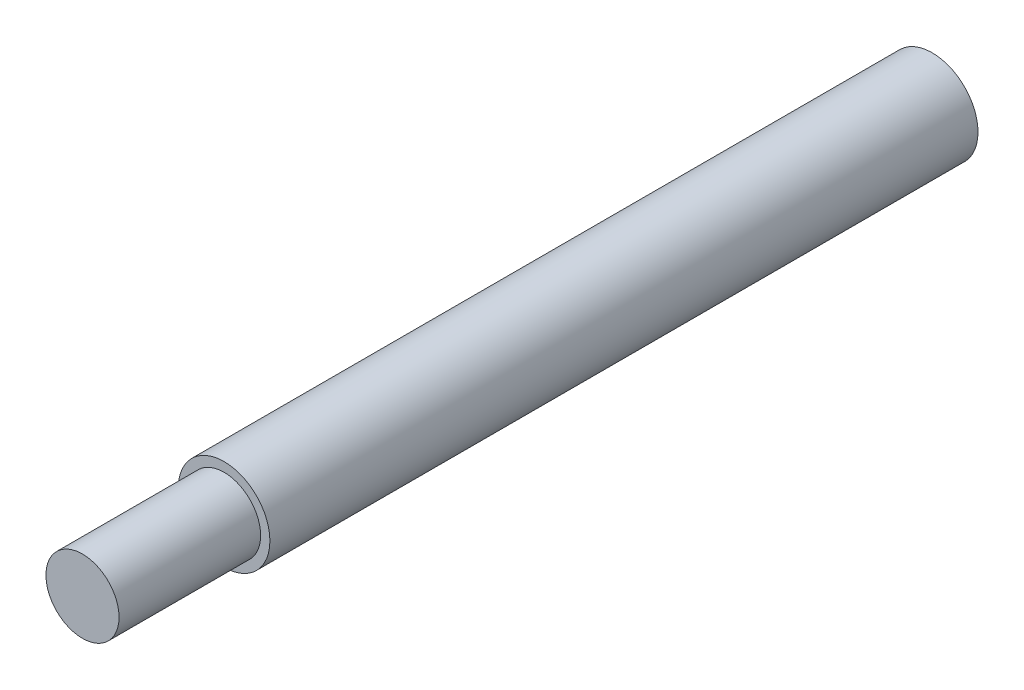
ISO-10303-21;
HEADER;
FILE_DESCRIPTION(('STEP AP214'),'2;1');
FILE_NAME('part.step','',(''),(''),'','','');
FILE_SCHEMA(('AUTOMOTIVE_DESIGN { 1 0 10303 214 1 1 1 1 }'));
ENDSEC;
DATA;
#1=APPLICATION_CONTEXT('core data for automotive mechanical design processes');
#2=APPLICATION_PROTOCOL_DEFINITION('international standard','automotive_design',2000,#1);
#3=PRODUCT_CONTEXT('',#1,'mechanical');
#4=PRODUCT('Part','Part','',(#3));
#5=PRODUCT_RELATED_PRODUCT_CATEGORY('part','',(#4));
#6=PRODUCT_DEFINITION_FORMATION('','',#4);
#7=PRODUCT_DEFINITION_CONTEXT('part definition',#1,'design');
#8=PRODUCT_DEFINITION('design','',#6,#7);
#9=PRODUCT_DEFINITION_SHAPE('','',#8);
#10=(LENGTH_UNIT() NAMED_UNIT(*) SI_UNIT(.MILLI.,.METRE.));
#11=(NAMED_UNIT(*) PLANE_ANGLE_UNIT() SI_UNIT($,.RADIAN.));
#12=(NAMED_UNIT(*) SI_UNIT($,.STERADIAN.) SOLID_ANGLE_UNIT());
#13=UNCERTAINTY_MEASURE_WITH_UNIT(LENGTH_MEASURE(1.E-05),#10,'distance_accuracy_value','');
#14=(GEOMETRIC_REPRESENTATION_CONTEXT(3) GLOBAL_UNCERTAINTY_ASSIGNED_CONTEXT((#13)) GLOBAL_UNIT_ASSIGNED_CONTEXT((#10,
#11,#12)) REPRESENTATION_CONTEXT('',''));
#15=CARTESIAN_POINT('',(0.,0.,0.));
#16=DIRECTION('',(0.,0.,1.));
#17=DIRECTION('',(1.,0.,0.));
#18=AXIS2_PLACEMENT_3D('',#15,#16,#17);
#19=CARTESIAN_POINT('',(0.,0.,155.));
#20=DIRECTION('',(0.,0.,1.));
#21=DIRECTION('',(1.,0.,0.));
#22=AXIS2_PLACEMENT_3D('',#19,#20,#21);
#23=PLANE('',#22);
#24=CARTESIAN_POINT('',(0.,0.,155.));
#25=DIRECTION('',(0.,0.,1.));
#26=DIRECTION('',(1.,0.,0.));
#27=AXIS2_PLACEMENT_3D('',#24,#25,#26);
#28=CIRCLE('',#27,10.025);
#29=CARTESIAN_POINT('',(10.025,0.,155.));
#30=VERTEX_POINT('',#29);
#31=EDGE_CURVE('E10',#30,#30,#28,.T.);
#32=ORIENTED_EDGE('',*,*,#31,.T.);
#33=EDGE_LOOP('',(#32));
#34=FACE_BOUND('',#33,.T.);
#35=CARTESIAN_POINT('',(0.,0.,155.));
#36=DIRECTION('',(0.,0.,1.));
#37=DIRECTION('',(1.,0.,0.));
#38=AXIS2_PLACEMENT_3D('',#35,#36,#37);
#39=CIRCLE('',#38,8.);
#40=CARTESIAN_POINT('',(8.,0.,155.));
#41=VERTEX_POINT('',#40);
#42=EDGE_CURVE('E46',#41,#41,#39,.T.);
#43=ORIENTED_EDGE('',*,*,#42,.F.);
#44=EDGE_LOOP('',(#43));
#45=FACE_BOUND('',#44,.T.);
#46=ADVANCED_FACE('F33',(#34,#45),#23,.T.);
#47=CARTESIAN_POINT('',(0.,0.,155.));
#48=DIRECTION('',(0.,0.,-1.));
#49=DIRECTION('',(-1.,0.,0.));
#50=AXIS2_PLACEMENT_3D('',#47,#48,#49);
#51=CYLINDRICAL_SURFACE('',#50,10.025);
#52=ORIENTED_EDGE('',*,*,#31,.F.);
#53=EDGE_LOOP('',(#52));
#54=FACE_BOUND('',#53,.T.);
#55=CARTESIAN_POINT('',(0.,0.,0.));
#56=DIRECTION('',(0.,0.,1.));
#57=DIRECTION('',(1.,0.,0.));
#58=AXIS2_PLACEMENT_3D('',#55,#56,#57);
#59=CIRCLE('',#58,10.025);
#60=CARTESIAN_POINT('',(10.025,0.,0.));
#61=VERTEX_POINT('',#60);
#62=EDGE_CURVE('E37',#61,#61,#59,.T.);
#63=ORIENTED_EDGE('',*,*,#62,.T.);
#64=EDGE_LOOP('',(#63));
#65=FACE_BOUND('',#64,.T.);
#66=ADVANCED_FACE('F35',(#54,#65),#51,.T.);
#67=CARTESIAN_POINT('',(0.,0.,0.));
#68=DIRECTION('',(0.,0.,1.));
#69=DIRECTION('',(1.,0.,0.));
#70=AXIS2_PLACEMENT_3D('',#67,#68,#69);
#71=PLANE('',#70);
#72=ORIENTED_EDGE('',*,*,#62,.F.);
#73=EDGE_LOOP('',(#72));
#74=FACE_BOUND('',#73,.T.);
#75=ADVANCED_FACE('F57',(#74),#71,.F.);
#76=CARTESIAN_POINT('',(0.,0.,186.));
#77=DIRECTION('',(0.,0.,-1.));
#78=DIRECTION('',(-1.,0.,0.));
#79=AXIS2_PLACEMENT_3D('',#76,#77,#78);
#80=CYLINDRICAL_SURFACE('',#79,8.);
#81=CARTESIAN_POINT('',(0.,0.,186.));
#82=DIRECTION('',(0.,0.,1.));
#83=DIRECTION('',(1.,0.,0.));
#84=AXIS2_PLACEMENT_3D('',#81,#82,#83);
#85=CIRCLE('',#84,8.);
#86=CARTESIAN_POINT('',(8.,0.,186.));
#87=VERTEX_POINT('',#86);
#88=EDGE_CURVE('E44',#87,#87,#85,.T.);
#89=ORIENTED_EDGE('',*,*,#88,.F.);
#90=EDGE_LOOP('',(#89));
#91=FACE_BOUND('',#90,.T.);
#92=ORIENTED_EDGE('',*,*,#42,.T.);
#93=EDGE_LOOP('',(#92));
#94=FACE_BOUND('',#93,.T.);
#95=ADVANCED_FACE('F54',(#91,#94),#80,.T.);
#96=CARTESIAN_POINT('',(0.,0.,186.));
#97=DIRECTION('',(0.,0.,1.));
#98=DIRECTION('',(1.,0.,0.));
#99=AXIS2_PLACEMENT_3D('',#96,#97,#98);
#100=PLANE('',#99);
#101=ORIENTED_EDGE('',*,*,#88,.T.);
#102=EDGE_LOOP('',(#101));
#103=FACE_BOUND('',#102,.T.);
#104=ADVANCED_FACE('F52',(#103),#100,.T.);
#105=CLOSED_SHELL('',(#46,#66,#75,#95,#104));
#106=MANIFOLD_SOLID_BREP('B2',#105);
#107=ADVANCED_BREP_SHAPE_REPRESENTATION('',(#18,#106),#14);
#108=SHAPE_DEFINITION_REPRESENTATION(#9,#107);
ENDSEC;
END-ISO-10303-21;
